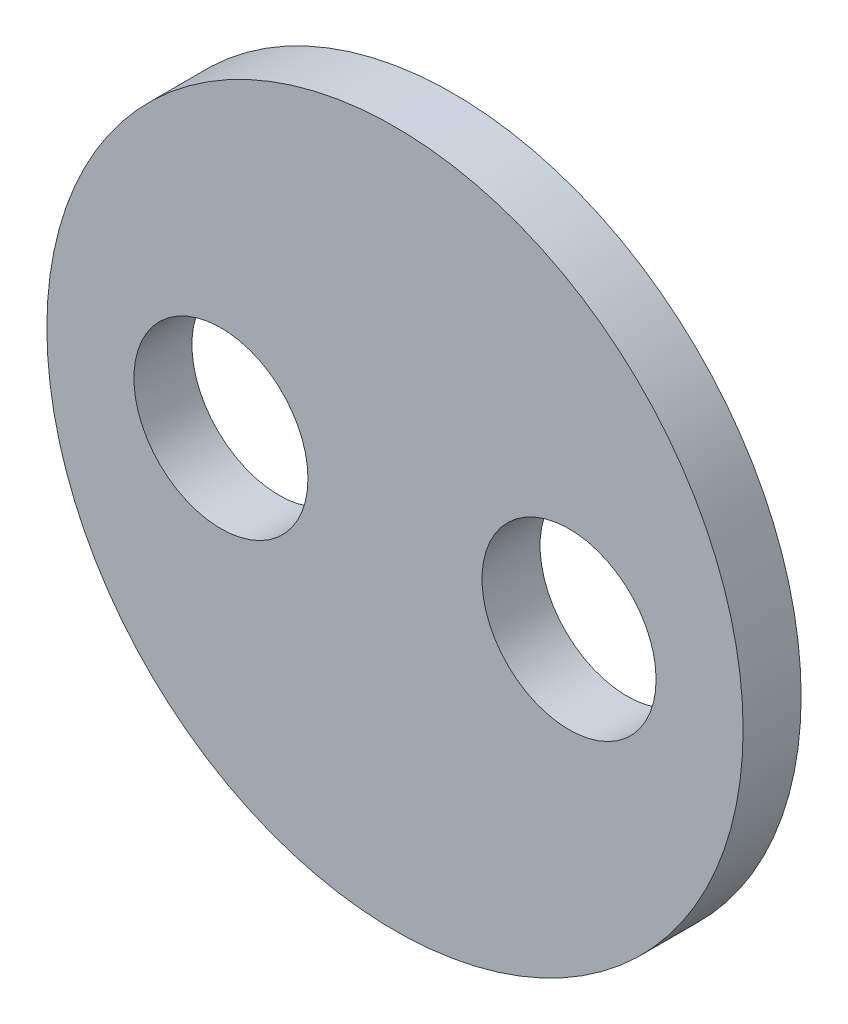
ISO-10303-21;
HEADER;
FILE_DESCRIPTION(('STEP AP214'),'2;1');
FILE_NAME('part.step','',(''),(''),'','','');
FILE_SCHEMA(('AUTOMOTIVE_DESIGN { 1 0 10303 214 1 1 1 1 }'));
ENDSEC;
DATA;
#1=APPLICATION_CONTEXT('core data for automotive mechanical design processes');
#2=APPLICATION_PROTOCOL_DEFINITION('international standard','automotive_design',2000,#1);
#3=PRODUCT_CONTEXT('',#1,'mechanical');
#4=PRODUCT('Part','Part','',(#3));
#5=PRODUCT_RELATED_PRODUCT_CATEGORY('part','',(#4));
#6=PRODUCT_DEFINITION_FORMATION('','',#4);
#7=PRODUCT_DEFINITION_CONTEXT('part definition',#1,'design');
#8=PRODUCT_DEFINITION('design','',#6,#7);
#9=PRODUCT_DEFINITION_SHAPE('','',#8);
#10=(LENGTH_UNIT() NAMED_UNIT(*) SI_UNIT(.MILLI.,.METRE.));
#11=(NAMED_UNIT(*) PLANE_ANGLE_UNIT() SI_UNIT($,.RADIAN.));
#12=(NAMED_UNIT(*) SI_UNIT($,.STERADIAN.) SOLID_ANGLE_UNIT());
#13=UNCERTAINTY_MEASURE_WITH_UNIT(LENGTH_MEASURE(1.E-05),#10,'distance_accuracy_value','');
#14=(GEOMETRIC_REPRESENTATION_CONTEXT(3) GLOBAL_UNCERTAINTY_ASSIGNED_CONTEXT((#13)) GLOBAL_UNIT_ASSIGNED_CONTEXT((#10,
#11,#12)) REPRESENTATION_CONTEXT('',''));
#15=CARTESIAN_POINT('',(0.,0.,0.));
#16=DIRECTION('',(0.,0.,1.));
#17=DIRECTION('',(1.,0.,0.));
#18=AXIS2_PLACEMENT_3D('',#15,#16,#17);
#19=CARTESIAN_POINT('',(0.,0.,1.));
#20=DIRECTION('',(0.,0.,-1.));
#21=DIRECTION('',(-1.,0.,0.));
#22=AXIS2_PLACEMENT_3D('',#19,#20,#21);
#23=CYLINDRICAL_SURFACE('',#22,6.);
#24=CARTESIAN_POINT('',(0.,0.,1.));
#25=DIRECTION('',(0.,0.,1.));
#26=DIRECTION('',(1.,0.,0.));
#27=AXIS2_PLACEMENT_3D('',#24,#25,#26);
#28=CIRCLE('',#27,6.);
#29=CARTESIAN_POINT('',(6.,0.,1.));
#30=VERTEX_POINT('',#29);
#31=EDGE_CURVE('E10',#30,#30,#28,.T.);
#32=ORIENTED_EDGE('',*,*,#31,.F.);
#33=EDGE_LOOP('',(#32));
#34=FACE_BOUND('',#33,.T.);
#35=CARTESIAN_POINT('',(0.,0.,0.));
#36=DIRECTION('',(0.,0.,1.));
#37=DIRECTION('',(1.,0.,0.));
#38=AXIS2_PLACEMENT_3D('',#35,#36,#37);
#39=CIRCLE('',#38,6.);
#40=CARTESIAN_POINT('',(6.,0.,0.));
#41=VERTEX_POINT('',#40);
#42=EDGE_CURVE('E47',#41,#41,#39,.T.);
#43=ORIENTED_EDGE('',*,*,#42,.T.);
#44=EDGE_LOOP('',(#43));
#45=FACE_BOUND('',#44,.T.);
#46=ADVANCED_FACE('F39',(#34,#45),#23,.T.);
#47=CARTESIAN_POINT('',(0.,0.,1.));
#48=DIRECTION('',(0.,0.,1.));
#49=DIRECTION('',(1.,0.,0.));
#50=AXIS2_PLACEMENT_3D('',#47,#48,#49);
#51=PLANE('',#50);
#52=CARTESIAN_POINT('',(-3.,0.,1.));
#53=DIRECTION('',(0.,0.,1.));
#54=DIRECTION('',(1.,0.,0.));
#55=AXIS2_PLACEMENT_3D('',#52,#53,#54);
#56=CIRCLE('',#55,1.5);
#57=CARTESIAN_POINT('',(-1.5,0.,1.));
#58=VERTEX_POINT('',#57);
#59=EDGE_CURVE('E60',#58,#58,#56,.T.);
#60=ORIENTED_EDGE('',*,*,#59,.F.);
#61=EDGE_LOOP('',(#60));
#62=FACE_BOUND('',#61,.T.);
#63=CARTESIAN_POINT('',(3.,0.,1.));
#64=DIRECTION('',(0.,0.,1.));
#65=DIRECTION('',(1.,0.,0.));
#66=AXIS2_PLACEMENT_3D('',#63,#64,#65);
#67=CIRCLE('',#66,1.5);
#68=CARTESIAN_POINT('',(4.5,0.,1.));
#69=VERTEX_POINT('',#68);
#70=EDGE_CURVE('E55',#69,#69,#67,.T.);
#71=ORIENTED_EDGE('',*,*,#70,.F.);
#72=EDGE_LOOP('',(#71));
#73=FACE_BOUND('',#72,.T.);
#74=ORIENTED_EDGE('',*,*,#31,.T.);
#75=EDGE_LOOP('',(#74));
#76=FACE_BOUND('',#75,.T.);
#77=ADVANCED_FACE('F76',(#62,#73,#76),#51,.T.);
#78=CARTESIAN_POINT('',(0.,0.,0.));
#79=DIRECTION('',(0.,0.,1.));
#80=DIRECTION('',(1.,0.,0.));
#81=AXIS2_PLACEMENT_3D('',#78,#79,#80);
#82=PLANE('',#81);
#83=CARTESIAN_POINT('',(-3.,0.,0.));
#84=DIRECTION('',(0.,0.,1.));
#85=DIRECTION('',(1.,0.,0.));
#86=AXIS2_PLACEMENT_3D('',#83,#84,#85);
#87=CIRCLE('',#86,1.5);
#88=CARTESIAN_POINT('',(-1.5,0.,0.));
#89=VERTEX_POINT('',#88);
#90=EDGE_CURVE('E42',#89,#89,#87,.T.);
#91=ORIENTED_EDGE('',*,*,#90,.T.);
#92=EDGE_LOOP('',(#91));
#93=FACE_BOUND('',#92,.T.);
#94=CARTESIAN_POINT('',(3.,0.,0.));
#95=DIRECTION('',(0.,0.,1.));
#96=DIRECTION('',(1.,0.,0.));
#97=AXIS2_PLACEMENT_3D('',#94,#95,#96);
#98=CIRCLE('',#97,1.5);
#99=CARTESIAN_POINT('',(4.5,0.,0.));
#100=VERTEX_POINT('',#99);
#101=EDGE_CURVE('E57',#100,#100,#98,.T.);
#102=ORIENTED_EDGE('',*,*,#101,.T.);
#103=EDGE_LOOP('',(#102));
#104=FACE_BOUND('',#103,.T.);
#105=ORIENTED_EDGE('',*,*,#42,.F.);
#106=EDGE_LOOP('',(#105));
#107=FACE_BOUND('',#106,.T.);
#108=ADVANCED_FACE('F78',(#93,#104,#107),#82,.F.);
#109=CARTESIAN_POINT('',(3.,0.,-1.));
#110=DIRECTION('',(0.,0.,1.));
#111=DIRECTION('',(1.,0.,0.));
#112=AXIS2_PLACEMENT_3D('',#109,#110,#111);
#113=CYLINDRICAL_SURFACE('',#112,1.5);
#114=ORIENTED_EDGE('',*,*,#70,.T.);
#115=EDGE_LOOP('',(#114));
#116=FACE_BOUND('',#115,.T.);
#117=ORIENTED_EDGE('',*,*,#101,.F.);
#118=EDGE_LOOP('',(#117));
#119=FACE_BOUND('',#118,.T.);
#120=ADVANCED_FACE('F73',(#116,#119),#113,.F.);
#121=CARTESIAN_POINT('',(-3.,0.,-1.));
#122=DIRECTION('',(0.,0.,1.));
#123=DIRECTION('',(1.,0.,0.));
#124=AXIS2_PLACEMENT_3D('',#121,#122,#123);
#125=CYLINDRICAL_SURFACE('',#124,1.5);
#126=ORIENTED_EDGE('',*,*,#59,.T.);
#127=EDGE_LOOP('',(#126));
#128=FACE_BOUND('',#127,.T.);
#129=ORIENTED_EDGE('',*,*,#90,.F.);
#130=EDGE_LOOP('',(#129));
#131=FACE_BOUND('',#130,.T.);
#132=ADVANCED_FACE('F90',(#128,#131),#125,.F.);
#133=CLOSED_SHELL('',(#46,#77,#108,#120,#132));
#134=MANIFOLD_SOLID_BREP('B2',#133);
#135=ADVANCED_BREP_SHAPE_REPRESENTATION('',(#18,#134),#14);
#136=SHAPE_DEFINITION_REPRESENTATION(#9,#135);
ENDSEC;
END-ISO-10303-21;
